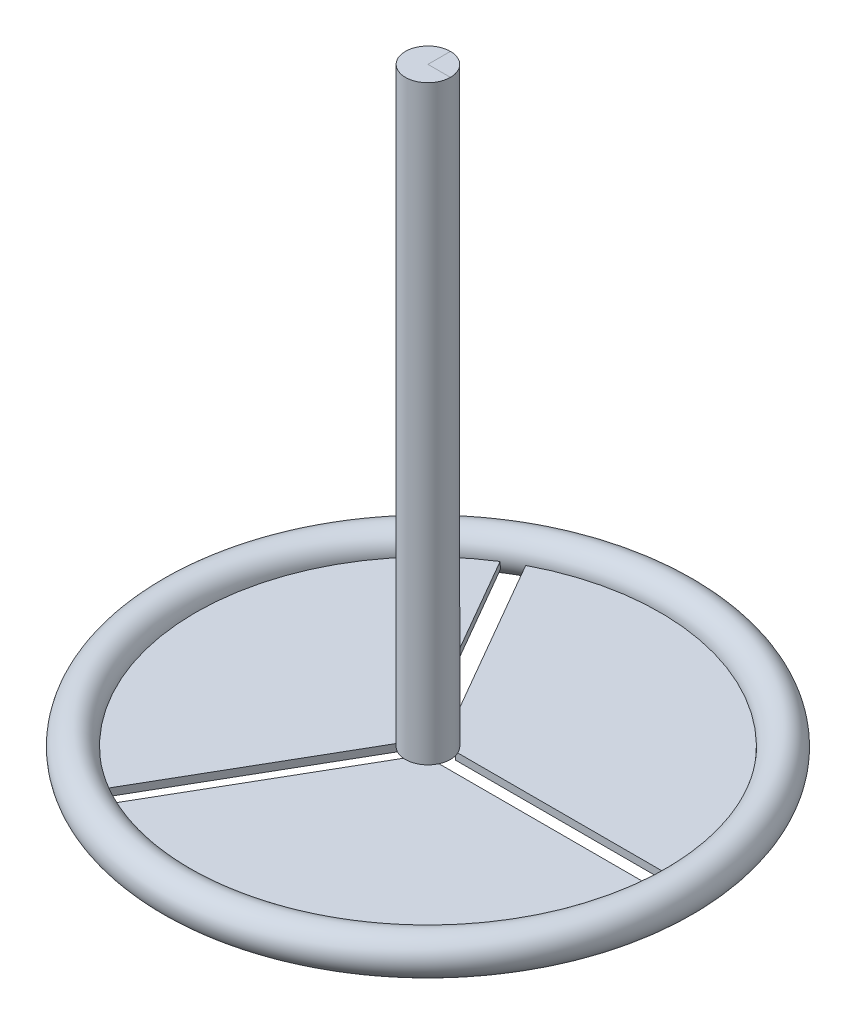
from build123d import *

# Parameters (mm, degrees)
SKETCH1_R          = 170
EXTRUDE1_DEPTH     = 5
SKETCH3_R          = 13.97
CUT_EXTRUDE1_DEPTH = 241.468293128
SKETCH4_W          = 148.448043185
SKETCH4_H          = 12.7
CUT_EXTRUDE2_DEPTH = 241.468293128
CIRPATTERN1_COUNT  = 3
SKETCH6_R          = 15.24
EXTRUDE2_DEPTH     = 400.05
SKETCH7_R          = 12.7


with BuildPart() as part:
    # Sketch1 → Extrude1 (new body)
    with BuildSketch(Plane(origin=(0, 0, -1215.314178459), x_dir=(1, 0, 0), z_dir=(0, 1, 0))):
        with Locations(Location((0, -1215.314178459, 0), (0, 0, 90))):
            Circle(SKETCH1_R)
    extrude(amount=-EXTRUDE1_DEPTH)

    # Sketch3 → Cut-Extrude1 (cut, through all)
    with BuildSketch(Plane(origin=(0, -5, 0), x_dir=(-1, 0, 0), z_dir=(0, -1, 0))):
        with Locations(Location((0, 0, 0), (0, 0, 90))):
            Circle(SKETCH3_R)
    extrude(amount=-CUT_EXTRUDE1_DEPTH, mode=Mode.SUBTRACT)

    # Sketch4 → Cut-Extrude2 (cut, through all)
    with BuildSketch(Plane(origin=(0, -5, 0), x_dir=(-1, 0, 0), z_dir=(0, -1, 0))):
        Polygon((725.189309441, 497.383213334), (737.889309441, 497.383213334), (813.025356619, 627.522664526), (800.325356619, 627.522664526), align=None)
        with Locations((646.481815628, 0)):
            Rectangle(SKETCH4_W, SKETCH4_H)
        Polygon((75.117385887, -142.806327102), (86.043861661, -136.333141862), (5.463237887, 3.23659262), (-5.463237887, -3.23659262), align=None)
    cut_extrude2 = extrude(amount=-CUT_EXTRUDE2_DEPTH, mode=Mode.SUBTRACT)

    # CirPattern1: Cut-Extrude2 ×3 about axis
    cirpattern1_axis = Axis((0, 0, 0), (0, 1, 0))
    for i in range(1, CIRPATTERN1_COUNT):
        add(cut_extrude2.rotate(cirpattern1_axis, i * 360 / CIRPATTERN1_COUNT), mode=Mode.SUBTRACT)

    # Sketch6 → Extrude2 (add)
    with BuildSketch(Plane(origin=(0, 0, 0), x_dir=(1, 0, 0), z_dir=(0, 1, 0))):
        with Locations(Location((0, 0, 0), (0, 0, 95.377339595))):
            Circle(SKETCH6_R)
    extrude(amount=EXTRUDE2_DEPTH)

    # Sketch7 → Revolve2 (revolve)
    with BuildSketch(Plane.XY, mode=Mode.PRIVATE) as revolve2_sk:
        with Locations((-170, 0)):
            Circle(SKETCH7_R)
    revolve(revolve2_sk.sketch.rotate(Axis((0, 400.05, 0), (0, -1, 0)), 60), axis=Axis((0, 400.05, 0), (0, -1, 0)))


solid = part.part
